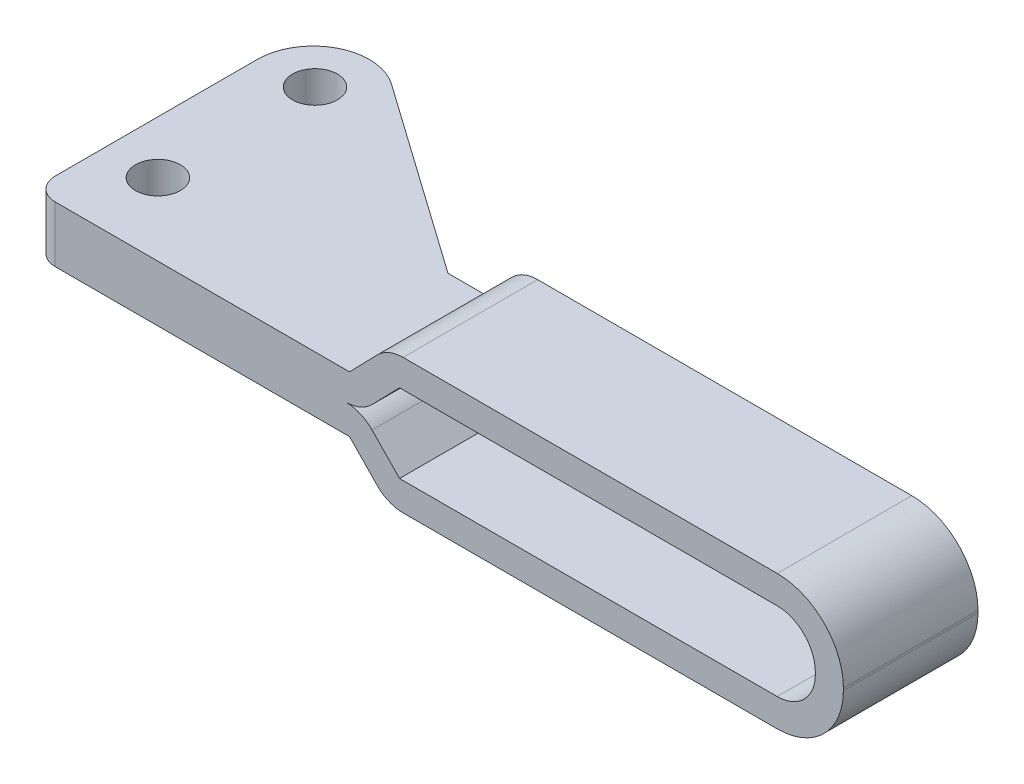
ISO-10303-21;
HEADER;
FILE_DESCRIPTION(('STEP AP214'),'2;1');
FILE_NAME('part.step','',(''),(''),'','','');
FILE_SCHEMA(('AUTOMOTIVE_DESIGN { 1 0 10303 214 1 1 1 1 }'));
ENDSEC;
DATA;
#1=APPLICATION_CONTEXT('core data for automotive mechanical design processes');
#2=APPLICATION_PROTOCOL_DEFINITION('international standard','automotive_design',2000,#1);
#3=PRODUCT_CONTEXT('',#1,'mechanical');
#4=PRODUCT('Part','Part','',(#3));
#5=PRODUCT_RELATED_PRODUCT_CATEGORY('part','',(#4));
#6=PRODUCT_DEFINITION_FORMATION('','',#4);
#7=PRODUCT_DEFINITION_CONTEXT('part definition',#1,'design');
#8=PRODUCT_DEFINITION('design','',#6,#7);
#9=PRODUCT_DEFINITION_SHAPE('','',#8);
#10=(LENGTH_UNIT() NAMED_UNIT(*) SI_UNIT(.MILLI.,.METRE.));
#11=(NAMED_UNIT(*) PLANE_ANGLE_UNIT() SI_UNIT($,.RADIAN.));
#12=(NAMED_UNIT(*) SI_UNIT($,.STERADIAN.) SOLID_ANGLE_UNIT());
#13=UNCERTAINTY_MEASURE_WITH_UNIT(LENGTH_MEASURE(1.E-05),#10,'distance_accuracy_value','');
#14=(GEOMETRIC_REPRESENTATION_CONTEXT(3) GLOBAL_UNCERTAINTY_ASSIGNED_CONTEXT((#13)) GLOBAL_UNIT_ASSIGNED_CONTEXT((#10,
#11,#12)) REPRESENTATION_CONTEXT('',''));
#15=CARTESIAN_POINT('',(0.,0.,0.));
#16=DIRECTION('',(0.,0.,1.));
#17=DIRECTION('',(1.,0.,0.));
#18=AXIS2_PLACEMENT_3D('',#15,#16,#17);
#19=CARTESIAN_POINT('',(0.,2.5,-14.));
#20=DIRECTION('',(0.,1.,0.));
#21=DIRECTION('',(-1.,0.,0.));
#22=AXIS2_PLACEMENT_3D('',#19,#20,#21);
#23=CYLINDRICAL_SURFACE('',#22,2.);
#24=CARTESIAN_POINT('',(0.,-2.49999999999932,-14.0000000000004));
#25=DIRECTION('',(0.,-1.,0.));
#26=DIRECTION('',(1.,0.,0.));
#27=AXIS2_PLACEMENT_3D('',#24,#25,#26);
#28=CIRCLE('',#27,2.);
#29=CARTESIAN_POINT('',(1.99999999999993,-2.49999999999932,-14.0000000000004));
#30=VERTEX_POINT('',#29);
#31=EDGE_CURVE('E495',#30,#30,#28,.T.);
#32=ORIENTED_EDGE('',*,*,#31,.T.);
#33=EDGE_LOOP('',(#32));
#34=FACE_BOUND('',#33,.T.);
#35=CARTESIAN_POINT('',(0.,2.5,-14.));
#36=DIRECTION('',(0.,1.,0.));
#37=DIRECTION('',(-1.,0.,0.));
#38=AXIS2_PLACEMENT_3D('',#35,#36,#37);
#39=CIRCLE('',#38,2.);
#40=CARTESIAN_POINT('',(-2.00000000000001,2.5,-14.));
#41=VERTEX_POINT('',#40);
#42=EDGE_CURVE('E11',#41,#41,#39,.T.);
#43=ORIENTED_EDGE('',*,*,#42,.T.);
#44=EDGE_LOOP('',(#43));
#45=FACE_BOUND('',#44,.T.);
#46=ADVANCED_FACE('F17',(#34,#45),#23,.F.);
#47=CARTESIAN_POINT('',(0.,2.5,0.));
#48=DIRECTION('',(0.,1.,0.));
#49=DIRECTION('',(-1.,0.,0.));
#50=AXIS2_PLACEMENT_3D('',#47,#48,#49);
#51=CYLINDRICAL_SURFACE('',#50,2.);
#52=CARTESIAN_POINT('',(0.,-2.49999999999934,-4.23272528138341E-13));
#53=DIRECTION('',(0.,-1.,0.));
#54=DIRECTION('',(1.,0.,0.));
#55=AXIS2_PLACEMENT_3D('',#52,#53,#54);
#56=CIRCLE('',#55,2.);
#57=CARTESIAN_POINT('',(1.99999999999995,-2.49999999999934,-4.26991775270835E-13));
#58=VERTEX_POINT('',#57);
#59=EDGE_CURVE('E388',#58,#58,#56,.T.);
#60=ORIENTED_EDGE('',*,*,#59,.T.);
#61=EDGE_LOOP('',(#60));
#62=FACE_BOUND('',#61,.T.);
#63=CARTESIAN_POINT('',(0.,2.5,0.));
#64=DIRECTION('',(0.,1.,0.));
#65=DIRECTION('',(-1.,0.,0.));
#66=AXIS2_PLACEMENT_3D('',#63,#64,#65);
#67=CIRCLE('',#66,2.);
#68=CARTESIAN_POINT('',(-1.99999999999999,2.5,0.));
#69=VERTEX_POINT('',#68);
#70=EDGE_CURVE('E28',#69,#69,#67,.T.);
#71=ORIENTED_EDGE('',*,*,#70,.T.);
#72=EDGE_LOOP('',(#71));
#73=FACE_BOUND('',#72,.T.);
#74=ADVANCED_FACE('F554',(#62,#73),#51,.F.);
#75=CARTESIAN_POINT('',(-3.99847823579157,6.00163537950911,4.45));
#76=DIRECTION('',(0.,1.,0.));
#77=DIRECTION('',(0.,0.,-1.));
#78=AXIS2_PLACEMENT_3D('',#75,#76,#77);
#79=PLANE('',#78);
#80=DIRECTION('',(1.,0.,0.));
#81=VECTOR('',#80,1.);
#82=CARTESIAN_POINT('',(69.0080963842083,6.00163537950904,6.44999999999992));
#83=LINE('',#82,#81);
#84=CARTESIAN_POINT('',(28.3021014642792,6.00163537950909,6.45));
#85=VERTEX_POINT('',#84);
#86=CARTESIAN_POINT('',(61.650000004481,6.00163537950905,6.45));
#87=VERTEX_POINT('',#86);
#88=EDGE_CURVE('E359',#85,#87,#83,.T.);
#89=ORIENTED_EDGE('',*,*,#88,.T.);
#90=DIRECTION('',(0.,0.,-1.));
#91=VECTOR('',#90,1.);
#92=CARTESIAN_POINT('',(61.650000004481,6.00163537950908,4.44999999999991));
#93=LINE('',#92,#91);
#94=CARTESIAN_POINT('',(61.6500000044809,6.00163537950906,-5.55000000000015));
#95=VERTEX_POINT('',#94);
#96=EDGE_CURVE('E42',#87,#95,#93,.T.);
#97=ORIENTED_EDGE('',*,*,#96,.T.);
#98=DIRECTION('',(-1.,0.,0.));
#99=VECTOR('',#98,1.);
#100=CARTESIAN_POINT('',(19.0080963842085,6.00163537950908,-5.55));
#101=LINE('',#100,#99);
#102=CARTESIAN_POINT('',(28.3021014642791,6.0016353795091,-5.55));
#103=VERTEX_POINT('',#102);
#104=EDGE_CURVE('E317',#95,#103,#101,.T.);
#105=ORIENTED_EDGE('',*,*,#104,.T.);
#106=DIRECTION('',(0.,0.,-1.));
#107=VECTOR('',#106,1.);
#108=CARTESIAN_POINT('',(28.3021014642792,6.00163537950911,4.44999999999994));
#109=LINE('',#108,#107);
#110=EDGE_CURVE('E266',#85,#103,#109,.T.);
#111=ORIENTED_EDGE('',*,*,#110,.F.);
#112=EDGE_LOOP('',(#89,#97,#105,#111));
#113=FACE_BOUND('',#112,.T.);
#114=ADVANCED_FACE('F549',(#113),#79,.T.);
#115=CARTESIAN_POINT('',(4.5700168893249,-16.9966869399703,4.44999999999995));
#116=DIRECTION('',(-0.716910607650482,0.697165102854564,0.));
#117=DIRECTION('',(0.,0.,-1.));
#118=AXIS2_PLACEMENT_3D('',#115,#116,#117);
#119=PLANE('',#118);
#120=DIRECTION('',(-0.697165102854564,-0.716910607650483,0.));
#121=VECTOR('',#120,1.);
#122=CARTESIAN_POINT('',(20.6093978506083,-0.503029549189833,-5.55));
#123=LINE('',#122,#121);
#124=CARTESIAN_POINT('',(25.9817485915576,5.02147995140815,-5.55));
#125=VERTEX_POINT('',#124);
#126=CARTESIAN_POINT('',(23.5297164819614,2.5,-5.55));
#127=VERTEX_POINT('',#126);
#128=EDGE_CURVE('E314',#125,#127,#123,.T.);
#129=ORIENTED_EDGE('',*,*,#128,.T.);
#130=DIRECTION('',(0.,0.,1.));
#131=VECTOR('',#130,1.);
#132=CARTESIAN_POINT('',(23.5297164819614,2.5,4.45));
#133=LINE('',#132,#131);
#134=CARTESIAN_POINT('',(23.5297164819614,2.5,6.45));
#135=VERTEX_POINT('',#134);
#136=EDGE_CURVE('E21',#127,#135,#133,.T.);
#137=ORIENTED_EDGE('',*,*,#136,.T.);
#138=DIRECTION('',(0.697165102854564,0.716910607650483,0.));
#139=VECTOR('',#138,1.);
#140=CARTESIAN_POINT('',(55.4676529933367,35.3425008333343,6.45));
#141=LINE('',#140,#139);
#142=CARTESIAN_POINT('',(25.9817485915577,5.02147995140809,6.45));
#143=VERTEX_POINT('',#142);
#144=EDGE_CURVE('E305',#135,#143,#141,.T.);
#145=ORIENTED_EDGE('',*,*,#144,.T.);
#146=DIRECTION('',(0.,0.,-1.));
#147=VECTOR('',#146,1.);
#148=CARTESIAN_POINT('',(25.9817485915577,5.02147995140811,4.44999999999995));
#149=LINE('',#148,#147);
#150=EDGE_CURVE('E308',#143,#125,#149,.T.);
#151=ORIENTED_EDGE('',*,*,#150,.T.);
#152=EDGE_LOOP('',(#129,#137,#145,#151));
#153=FACE_BOUND('',#152,.T.);
#154=ADVANCED_FACE('F543',(#153),#119,.T.);
#155=CARTESIAN_POINT('',(20.6093978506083,-0.503029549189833,-5.55));
#156=DIRECTION('',(0.,0.,1.));
#157=DIRECTION('',(-0.697165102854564,0.716910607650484,0.));
#158=AXIS2_PLACEMENT_3D('',#155,#156,#157);
#159=PLANE('',#158);
#160=CARTESIAN_POINT('',(61.6500000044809,-0.101635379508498,-5.55000000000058));
#161=DIRECTION('',(0.,0.,-1.));
#162=DIRECTION('',(0.,-1.,0.));
#163=AXIS2_PLACEMENT_3D('',#160,#161,#162);
#164=CIRCLE('',#163,3.4);
#165=CARTESIAN_POINT('',(65.0500000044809,-0.101635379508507,-5.55000000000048));
#166=VERTEX_POINT('',#165);
#167=CARTESIAN_POINT('',(61.6500000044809,-3.50163537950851,-5.55000000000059));
#168=VERTEX_POINT('',#167);
#169=EDGE_CURVE('E400',#166,#168,#164,.T.);
#170=ORIENTED_EDGE('',*,*,#169,.F.);
#171=DIRECTION('',(0.,1.,0.));
#172=VECTOR('',#171,1.);
#173=CARTESIAN_POINT('',(65.0500000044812,50.0477419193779,-5.55000000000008));
#174=LINE('',#173,#172);
#175=CARTESIAN_POINT('',(65.050000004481,0.101635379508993,-5.55000000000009));
#176=VERTEX_POINT('',#175);
#177=EDGE_CURVE('E271',#166,#176,#174,.T.);
#178=ORIENTED_EDGE('',*,*,#177,.T.);
#179=CARTESIAN_POINT('',(61.6500000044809,0.101635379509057,-5.55000000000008));
#180=DIRECTION('',(0.,0.,1.));
#181=DIRECTION('',(-0.697165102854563,0.716910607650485,0.));
#182=AXIS2_PLACEMENT_3D('',#179,#180,#181);
#183=CIRCLE('',#182,3.4);
#184=CARTESIAN_POINT('',(61.6500000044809,3.50163537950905,-5.55));
#185=VERTEX_POINT('',#184);
#186=EDGE_CURVE('E245',#176,#185,#183,.T.);
#187=ORIENTED_EDGE('',*,*,#186,.T.);
#188=DIRECTION('',(-1.,0.,0.));
#189=VECTOR('',#188,1.);
#190=CARTESIAN_POINT('',(19.0080963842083,3.50163537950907,-5.55000000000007));
#191=LINE('',#190,#189);
#192=CARTESIAN_POINT('',(27.9909494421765,3.50163537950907,-5.55));
#193=VERTEX_POINT('',#192);
#194=EDGE_CURVE('E257',#185,#193,#191,.T.);
#195=ORIENTED_EDGE('',*,*,#194,.T.);
#196=DIRECTION('',(-0.697165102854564,-0.716910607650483,0.));
#197=VECTOR('',#196,1.);
#198=CARTESIAN_POINT('',(22.4016743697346,-2.24594230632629,-5.55));
#199=LINE('',#198,#197);
#200=CARTESIAN_POINT('',(25.5389173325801,0.980155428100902,-5.55));
#201=VERTEX_POINT('',#200);
#202=EDGE_CURVE('E351',#193,#201,#199,.T.);
#203=ORIENTED_EDGE('',*,*,#202,.T.);
#204=CARTESIAN_POINT('',(23.2185644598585,3.2366,-5.55));
#205=DIRECTION('',(0.,0.,-1.));
#206=DIRECTION('',(-0.697165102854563,0.716910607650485,0.));
#207=AXIS2_PLACEMENT_3D('',#204,#205,#206);
#208=CIRCLE('',#207,3.2366);
#209=CARTESIAN_POINT('',(23.2185644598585,0.,-5.55));
#210=VERTEX_POINT('',#209);
#211=EDGE_CURVE('E301',#201,#210,#208,.T.);
#212=ORIENTED_EDGE('',*,*,#211,.T.);
#213=CARTESIAN_POINT('',(23.2185644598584,-3.23659999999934,-5.55000000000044));
#214=DIRECTION('',(0.,0.,1.));
#215=DIRECTION('',(0.,1.,0.));
#216=AXIS2_PLACEMENT_3D('',#213,#214,#215);
#217=CIRCLE('',#216,3.2366);
#218=CARTESIAN_POINT('',(25.5389173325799,-0.980155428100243,-5.55000000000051));
#219=VERTEX_POINT('',#218);
#220=EDGE_CURVE('E455',#219,#210,#217,.T.);
#221=ORIENTED_EDGE('',*,*,#220,.F.);
#222=DIRECTION('',(-0.697165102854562,0.716910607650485,0.));
#223=VECTOR('',#222,1.);
#224=CARTESIAN_POINT('',(22.4016743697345,2.24594230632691,-5.5500000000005));
#225=LINE('',#224,#223);
#226=CARTESIAN_POINT('',(27.9909494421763,-3.50163537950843,-5.55));
#227=VERTEX_POINT('',#226);
#228=EDGE_CURVE('E395',#227,#219,#225,.T.);
#229=ORIENTED_EDGE('',*,*,#228,.F.);
#230=DIRECTION('',(-1.,0.,0.));
#231=VECTOR('',#230,1.);
#232=CARTESIAN_POINT('',(19.0080963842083,-3.50163537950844,-5.5500000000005));
#233=LINE('',#232,#231);
#234=EDGE_CURVE('E424',#168,#227,#233,.T.);
#235=ORIENTED_EDGE('',*,*,#234,.F.);
#236=EDGE_LOOP('',(#170,#178,#187,#195,#203,#212,#221,#229,#235));
#237=FACE_BOUND('',#236,.T.);
#238=DIRECTION('',(0.,1.,0.));
#239=VECTOR('',#238,1.);
#240=CARTESIAN_POINT('',(67.5500000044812,50.0477419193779,-5.55));
#241=LINE('',#240,#239);
#242=CARTESIAN_POINT('',(67.5500000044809,-0.101635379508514,-5.55000000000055));
#243=VERTEX_POINT('',#242);
#244=CARTESIAN_POINT('',(67.5500000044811,0.101635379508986,-5.55000000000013));
#245=VERTEX_POINT('',#244);
#246=EDGE_CURVE('E288',#243,#245,#241,.T.);
#247=ORIENTED_EDGE('',*,*,#246,.F.);
#248=CARTESIAN_POINT('',(61.6500000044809,-0.101635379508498,-5.55000000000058));
#249=DIRECTION('',(0.,0.,-1.));
#250=DIRECTION('',(0.,-1.,0.));
#251=AXIS2_PLACEMENT_3D('',#248,#249,#250);
#252=CIRCLE('',#251,5.9);
#253=CARTESIAN_POINT('',(61.6500000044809,-6.0016353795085,-5.55000000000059));
#254=VERTEX_POINT('',#253);
#255=EDGE_CURVE('E432',#243,#254,#252,.T.);
#256=ORIENTED_EDGE('',*,*,#255,.T.);
#257=DIRECTION('',(-1.,0.,0.));
#258=VECTOR('',#257,1.);
#259=CARTESIAN_POINT('',(19.0080963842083,-6.00163537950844,-5.55000000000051));
#260=LINE('',#259,#258);
#261=CARTESIAN_POINT('',(28.3021014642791,-6.00163537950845,-5.5500000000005));
#262=VERTEX_POINT('',#261);
#263=EDGE_CURVE('E446',#254,#262,#260,.T.);
#264=ORIENTED_EDGE('',*,*,#263,.T.);
#265=CARTESIAN_POINT('',(28.3021014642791,-2.76503537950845,-5.55000000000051));
#266=DIRECTION('',(0.,0.,-1.));
#267=DIRECTION('',(-0.697165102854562,0.716910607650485,0.));
#268=AXIS2_PLACEMENT_3D('',#265,#266,#267);
#269=CIRCLE('',#268,3.2366);
#270=CARTESIAN_POINT('',(25.9817485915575,-5.02147995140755,-5.55000000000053));
#271=VERTEX_POINT('',#270);
#272=EDGE_CURVE('E399',#262,#271,#269,.T.);
#273=ORIENTED_EDGE('',*,*,#272,.T.);
#274=DIRECTION('',(-0.697165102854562,0.716910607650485,0.));
#275=VECTOR('',#274,1.);
#276=CARTESIAN_POINT('',(20.6093978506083,0.503029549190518,-5.55000000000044));
#277=LINE('',#276,#275);
#278=CARTESIAN_POINT('',(23.5297164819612,-2.49999999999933,-5.55));
#279=VERTEX_POINT('',#278);
#280=EDGE_CURVE('E428',#271,#279,#277,.T.);
#281=ORIENTED_EDGE('',*,*,#280,.T.);
#282=DIRECTION('',(-1.,0.,0.));
#283=VECTOR('',#282,1.);
#284=CARTESIAN_POINT('',(20.3065746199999,-2.49999999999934,-5.55000000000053));
#285=LINE('',#284,#283);
#286=CARTESIAN_POINT('',(20.3065746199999,-2.49999999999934,-5.55000000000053));
#287=VERTEX_POINT('',#286);
#288=EDGE_CURVE('E440',#279,#287,#285,.T.);
#289=ORIENTED_EDGE('',*,*,#288,.T.);
#290=DIRECTION('',(0.,-1.,0.));
#291=VECTOR('',#290,1.);
#292=CARTESIAN_POINT('',(20.30657462,2.49999999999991,-5.55));
#293=LINE('',#292,#291);
#294=CARTESIAN_POINT('',(20.30657462,2.49999999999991,-5.55));
#295=VERTEX_POINT('',#294);
#296=EDGE_CURVE('E313',#295,#287,#293,.T.);
#297=ORIENTED_EDGE('',*,*,#296,.F.);
#298=DIRECTION('',(-1.,0.,0.));
#299=VECTOR('',#298,1.);
#300=CARTESIAN_POINT('',(20.30657462,2.49999999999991,-5.55));
#301=LINE('',#300,#299);
#302=EDGE_CURVE('E320',#127,#295,#301,.T.);
#303=ORIENTED_EDGE('',*,*,#302,.F.);
#304=ORIENTED_EDGE('',*,*,#128,.F.);
#305=CARTESIAN_POINT('',(28.3021014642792,2.76503537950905,-5.55000000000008));
#306=DIRECTION('',(0.,0.,1.));
#307=DIRECTION('',(1.,0.,0.));
#308=AXIS2_PLACEMENT_3D('',#305,#306,#307);
#309=CIRCLE('',#308,3.2366);
#310=EDGE_CURVE('E329',#103,#125,#309,.T.);
#311=ORIENTED_EDGE('',*,*,#310,.F.);
#312=ORIENTED_EDGE('',*,*,#104,.F.);
#313=CARTESIAN_POINT('',(61.6500000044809,0.101635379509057,-5.55000000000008));
#314=DIRECTION('',(0.,0.,1.));
#315=DIRECTION('',(0.697165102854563,-0.716910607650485,0.));
#316=AXIS2_PLACEMENT_3D('',#313,#314,#315);
#317=CIRCLE('',#316,5.9);
#318=EDGE_CURVE('E283',#245,#95,#317,.T.);
#319=ORIENTED_EDGE('',*,*,#318,.F.);
#320=EDGE_LOOP('',(#247,#256,#264,#273,#281,#289,#297,#303,#304,#311,#312,#319));
#321=FACE_BOUND('',#320,.T.);
#322=ADVANCED_FACE('F269',(#237,#321),#159,.F.);
#323=CARTESIAN_POINT('',(55.4676529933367,35.3425008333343,6.45));
#324=DIRECTION('',(0.,0.,-1.));
#325=DIRECTION('',(0.697165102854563,-0.716910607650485,0.));
#326=AXIS2_PLACEMENT_3D('',#323,#324,#325);
#327=PLANE('',#326);
#328=DIRECTION('',(0.,-1.,0.));
#329=VECTOR('',#328,1.);
#330=CARTESIAN_POINT('',(65.0500000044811,0.0477419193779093,6.44999999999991));
#331=LINE('',#330,#329);
#332=CARTESIAN_POINT('',(65.0500000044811,0.101635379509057,6.44999999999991));
#333=VERTEX_POINT('',#332);
#334=CARTESIAN_POINT('',(65.050000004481,-0.101635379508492,6.44999999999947));
#335=VERTEX_POINT('',#334);
#336=EDGE_CURVE('E291',#333,#335,#331,.T.);
#337=ORIENTED_EDGE('',*,*,#336,.T.);
#338=CARTESIAN_POINT('',(61.650000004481,-0.101635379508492,6.44999999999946));
#339=DIRECTION('',(0.,0.,1.));
#340=DIRECTION('',(0.,1.,0.));
#341=AXIS2_PLACEMENT_3D('',#338,#339,#340);
#342=CIRCLE('',#341,3.4);
#343=CARTESIAN_POINT('',(61.6500000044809,-3.5016353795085,6.44999999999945));
#344=VERTEX_POINT('',#343);
#345=EDGE_CURVE('E404',#344,#335,#342,.T.);
#346=ORIENTED_EDGE('',*,*,#345,.F.);
#347=DIRECTION('',(1.,0.,0.));
#348=VECTOR('',#347,1.);
#349=CARTESIAN_POINT('',(69.0080963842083,-3.50163537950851,6.44999999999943));
#350=LINE('',#349,#348);
#351=CARTESIAN_POINT('',(27.9909494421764,-3.50163537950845,6.45));
#352=VERTEX_POINT('',#351);
#353=EDGE_CURVE('E389',#352,#344,#350,.T.);
#354=ORIENTED_EDGE('',*,*,#353,.F.);
#355=DIRECTION('',(0.697165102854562,-0.716910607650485,0.));
#356=VECTOR('',#355,1.);
#357=CARTESIAN_POINT('',(57.2599295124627,-33.5995880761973,6.44999999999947));
#358=LINE('',#357,#356);
#359=CARTESIAN_POINT('',(25.53891733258,-0.98015542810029,6.44999999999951));
#360=VERTEX_POINT('',#359);
#361=EDGE_CURVE('E394',#360,#352,#358,.T.);
#362=ORIENTED_EDGE('',*,*,#361,.F.);
#363=CARTESIAN_POINT('',(23.2185644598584,-3.23659999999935,6.44999999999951));
#364=DIRECTION('',(0.,0.,-1.));
#365=DIRECTION('',(0.,-1.,0.));
#366=AXIS2_PLACEMENT_3D('',#363,#364,#365);
#367=CIRCLE('',#366,3.2366);
#368=CARTESIAN_POINT('',(23.2185644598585,0.,6.45));
#369=VERTEX_POINT('',#368);
#370=EDGE_CURVE('E485',#369,#360,#367,.T.);
#371=ORIENTED_EDGE('',*,*,#370,.F.);
#372=CARTESIAN_POINT('',(23.2185644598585,3.23659999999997,6.45));
#373=DIRECTION('',(0.,0.,1.));
#374=DIRECTION('',(-0.697165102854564,0.716910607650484,0.));
#375=AXIS2_PLACEMENT_3D('',#372,#373,#374);
#376=CIRCLE('',#375,3.2366);
#377=CARTESIAN_POINT('',(25.5389173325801,0.980155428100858,6.45));
#378=VERTEX_POINT('',#377);
#379=EDGE_CURVE('E297',#369,#378,#376,.T.);
#380=ORIENTED_EDGE('',*,*,#379,.T.);
#381=DIRECTION('',(0.697165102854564,0.716910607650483,0.));
#382=VECTOR('',#381,1.);
#383=CARTESIAN_POINT('',(57.2599295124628,33.5995880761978,6.44999999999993));
#384=LINE('',#383,#382);
#385=CARTESIAN_POINT('',(27.9909494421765,3.50163537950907,6.45));
#386=VERTEX_POINT('',#385);
#387=EDGE_CURVE('E348',#378,#386,#384,.T.);
#388=ORIENTED_EDGE('',*,*,#387,.T.);
#389=DIRECTION('',(1.,0.,0.));
#390=VECTOR('',#389,1.);
#391=CARTESIAN_POINT('',(69.0080963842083,3.50163537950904,6.4499999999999));
#392=LINE('',#391,#390);
#393=CARTESIAN_POINT('',(61.650000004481,3.50163537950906,6.44999999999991));
#394=VERTEX_POINT('',#393);
#395=EDGE_CURVE('E265',#386,#394,#392,.T.);
#396=ORIENTED_EDGE('',*,*,#395,.T.);
#397=CARTESIAN_POINT('',(61.650000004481,0.101635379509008,6.4499999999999));
#398=DIRECTION('',(0.,0.,-1.));
#399=DIRECTION('',(-0.697165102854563,0.716910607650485,0.));
#400=AXIS2_PLACEMENT_3D('',#397,#398,#399);
#401=CIRCLE('',#400,3.4);
#402=EDGE_CURVE('E248',#394,#333,#401,.T.);
#403=ORIENTED_EDGE('',*,*,#402,.T.);
#404=EDGE_LOOP('',(#337,#346,#354,#362,#371,#380,#388,#396,#403));
#405=FACE_BOUND('',#404,.T.);
#406=ORIENTED_EDGE('',*,*,#144,.F.);
#407=DIRECTION('',(1.,0.,0.));
#408=VECTOR('',#407,1.);
#409=CARTESIAN_POINT('',(70.30657462,2.49999999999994,6.44999999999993));
#410=LINE('',#409,#408);
#411=CARTESIAN_POINT('',(-2.69999999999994,2.5,6.45));
#412=VERTEX_POINT('',#411);
#413=EDGE_CURVE('E287',#412,#135,#410,.T.);
#414=ORIENTED_EDGE('',*,*,#413,.F.);
#415=DIRECTION('',(0.,-1.,0.));
#416=VECTOR('',#415,1.);
#417=CARTESIAN_POINT('',(-2.69999999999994,2.5,6.45));
#418=LINE('',#417,#416);
#419=CARTESIAN_POINT('',(-2.70000000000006,-2.49999999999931,6.44999999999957));
#420=VERTEX_POINT('',#419);
#421=EDGE_CURVE('E295',#412,#420,#418,.T.);
#422=ORIENTED_EDGE('',*,*,#421,.T.);
#423=DIRECTION('',(1.,0.,0.));
#424=VECTOR('',#423,1.);
#425=CARTESIAN_POINT('',(70.3065746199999,-2.4999999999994,6.44999999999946));
#426=LINE('',#425,#424);
#427=CARTESIAN_POINT('',(23.5297164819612,-2.49999999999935,6.45));
#428=VERTEX_POINT('',#427);
#429=EDGE_CURVE('E437',#420,#428,#426,.T.);
#430=ORIENTED_EDGE('',*,*,#429,.T.);
#431=DIRECTION('',(0.697165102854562,-0.716910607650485,0.));
#432=VECTOR('',#431,1.);
#433=CARTESIAN_POINT('',(55.4676529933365,-35.3425008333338,6.4499999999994));
#434=LINE('',#433,#432);
#435=CARTESIAN_POINT('',(25.9817485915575,-5.02147995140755,6.44999999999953));
#436=VERTEX_POINT('',#435);
#437=EDGE_CURVE('E442',#428,#436,#434,.T.);
#438=ORIENTED_EDGE('',*,*,#437,.T.);
#439=CARTESIAN_POINT('',(28.3021014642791,-2.7650353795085,6.44999999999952));
#440=DIRECTION('',(0.,0.,1.));
#441=DIRECTION('',(-0.697165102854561,0.716910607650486,0.));
#442=AXIS2_PLACEMENT_3D('',#439,#440,#441);
#443=CIRCLE('',#442,3.2366);
#444=CARTESIAN_POINT('',(28.3021014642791,-6.0016353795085,6.44999999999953));
#445=VERTEX_POINT('',#444);
#446=EDGE_CURVE('E409',#436,#445,#443,.T.);
#447=ORIENTED_EDGE('',*,*,#446,.T.);
#448=DIRECTION('',(1.,0.,0.));
#449=VECTOR('',#448,1.);
#450=CARTESIAN_POINT('',(69.0080963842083,-6.00163537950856,6.44999999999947));
#451=LINE('',#450,#449);
#452=CARTESIAN_POINT('',(61.6500000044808,-6.00163537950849,6.44999999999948));
#453=VERTEX_POINT('',#452);
#454=EDGE_CURVE('E462',#445,#453,#451,.T.);
#455=ORIENTED_EDGE('',*,*,#454,.T.);
#456=CARTESIAN_POINT('',(61.650000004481,-0.101635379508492,6.44999999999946));
#457=DIRECTION('',(0.,0.,1.));
#458=DIRECTION('',(0.,-1.,0.));
#459=AXIS2_PLACEMENT_3D('',#456,#457,#458);
#460=CIRCLE('',#459,5.9);
#461=CARTESIAN_POINT('',(67.550000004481,-0.101635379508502,6.44999999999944));
#462=VERTEX_POINT('',#461);
#463=EDGE_CURVE('E431',#453,#462,#460,.T.);
#464=ORIENTED_EDGE('',*,*,#463,.T.);
#465=DIRECTION('',(0.,-1.,0.));
#466=VECTOR('',#465,1.);
#467=CARTESIAN_POINT('',(67.550000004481,0.0477419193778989,6.45));
#468=LINE('',#467,#466);
#469=CARTESIAN_POINT('',(67.550000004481,0.101635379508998,6.45));
#470=VERTEX_POINT('',#469);
#471=EDGE_CURVE('E254',#470,#462,#468,.T.);
#472=ORIENTED_EDGE('',*,*,#471,.F.);
#473=CARTESIAN_POINT('',(61.650000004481,0.101635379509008,6.4499999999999));
#474=DIRECTION('',(0.,0.,-1.));
#475=DIRECTION('',(-0.697165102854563,0.716910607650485,0.));
#476=AXIS2_PLACEMENT_3D('',#473,#474,#475);
#477=CIRCLE('',#476,5.9);
#478=EDGE_CURVE('E253',#87,#470,#477,.T.);
#479=ORIENTED_EDGE('',*,*,#478,.F.);
#480=ORIENTED_EDGE('',*,*,#88,.F.);
#481=CARTESIAN_POINT('',(28.3021014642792,2.76503537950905,6.45));
#482=DIRECTION('',(0.,0.,-1.));
#483=DIRECTION('',(0.,-1.,0.));
#484=AXIS2_PLACEMENT_3D('',#481,#482,#483);
#485=CIRCLE('',#484,3.2366);
#486=EDGE_CURVE('E335',#143,#85,#485,.T.);
#487=ORIENTED_EDGE('',*,*,#486,.F.);
#488=EDGE_LOOP('',(#406,#414,#422,#430,#438,#447,#455,#464,#472,#479,#480,#487));
#489=FACE_BOUND('',#488,.T.);
#490=ADVANCED_FACE('F542',(#405,#489),#327,.F.);
#491=CARTESIAN_POINT('',(6.36229340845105,-18.7395996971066,4.45));
#492=DIRECTION('',(-0.716910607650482,0.697165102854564,0.));
#493=DIRECTION('',(0.,0.,-1.));
#494=AXIS2_PLACEMENT_3D('',#491,#492,#493);
#495=PLANE('',#494);
#496=DIRECTION('',(0.,0.,1.));
#497=VECTOR('',#496,1.);
#498=CARTESIAN_POINT('',(25.5389173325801,0.980155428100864,4.44999999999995));
#499=LINE('',#498,#497);
#500=EDGE_CURVE('E279',#201,#378,#499,.T.);
#501=ORIENTED_EDGE('',*,*,#500,.F.);
#502=ORIENTED_EDGE('',*,*,#202,.F.);
#503=DIRECTION('',(0.,0.,-1.));
#504=VECTOR('',#503,1.);
#505=CARTESIAN_POINT('',(27.9909494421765,3.50163537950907,4.45));
#506=LINE('',#505,#504);
#507=EDGE_CURVE('E260',#386,#193,#506,.T.);
#508=ORIENTED_EDGE('',*,*,#507,.F.);
#509=ORIENTED_EDGE('',*,*,#387,.F.);
#510=EDGE_LOOP('',(#501,#502,#508,#509));
#511=FACE_BOUND('',#510,.T.);
#512=ADVANCED_FACE('F563',(#511),#495,.F.);
#513=CARTESIAN_POINT('',(-3.99847823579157,3.5016353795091,4.45));
#514=DIRECTION('',(0.,1.,0.));
#515=DIRECTION('',(0.,0.,-1.));
#516=AXIS2_PLACEMENT_3D('',#513,#514,#515);
#517=PLANE('',#516);
#518=DIRECTION('',(0.,0.,-1.));
#519=VECTOR('',#518,1.);
#520=CARTESIAN_POINT('',(61.650000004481,3.50163537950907,4.44999999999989));
#521=LINE('',#520,#519);
#522=EDGE_CURVE('E241',#394,#185,#521,.T.);
#523=ORIENTED_EDGE('',*,*,#522,.F.);
#524=ORIENTED_EDGE('',*,*,#395,.F.);
#525=ORIENTED_EDGE('',*,*,#507,.T.);
#526=ORIENTED_EDGE('',*,*,#194,.F.);
#527=EDGE_LOOP('',(#523,#524,#525,#526));
#528=FACE_BOUND('',#527,.T.);
#529=ADVANCED_FACE('F258',(#528),#517,.F.);
#530=CARTESIAN_POINT('',(28.3021014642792,2.76503537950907,-11.9100880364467));
#531=DIRECTION('',(0.,0.,1.));
#532=DIRECTION('',(1.,0.,0.));
#533=AXIS2_PLACEMENT_3D('',#530,#531,#532);
#534=CYLINDRICAL_SURFACE('',#533,3.2366);
#535=ORIENTED_EDGE('',*,*,#110,.T.);
#536=ORIENTED_EDGE('',*,*,#310,.T.);
#537=ORIENTED_EDGE('',*,*,#150,.F.);
#538=ORIENTED_EDGE('',*,*,#486,.T.);
#539=EDGE_LOOP('',(#535,#536,#537,#538));
#540=FACE_BOUND('',#539,.T.);
#541=ADVANCED_FACE('F589',(#540),#534,.T.);
#542=CARTESIAN_POINT('',(-2.7,2.5,4.45));
#543=DIRECTION('',(0.,-1.,0.));
#544=DIRECTION('',(1.,0.,0.));
#545=AXIS2_PLACEMENT_3D('',#542,#543,#544);
#546=CYLINDRICAL_SURFACE('',#545,2.);
#547=DIRECTION('',(0.,-1.,0.));
#548=VECTOR('',#547,1.);
#549=CARTESIAN_POINT('',(-4.7,2.50000000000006,4.45));
#550=LINE('',#549,#548);
#551=CARTESIAN_POINT('',(-4.7,2.50000000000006,4.45));
#552=VERTEX_POINT('',#551);
#553=CARTESIAN_POINT('',(-4.7,-2.4999999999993,4.4499999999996));
#554=VERTEX_POINT('',#553);
#555=EDGE_CURVE('E324',#552,#554,#550,.T.);
#556=ORIENTED_EDGE('',*,*,#555,.T.);
#557=CARTESIAN_POINT('',(-2.7,-2.49999999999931,4.44999999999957));
#558=DIRECTION('',(0.,1.,0.));
#559=DIRECTION('',(-1.,0.,0.));
#560=AXIS2_PLACEMENT_3D('',#557,#558,#559);
#561=CIRCLE('',#560,2.);
#562=EDGE_CURVE('E410',#554,#420,#561,.T.);
#563=ORIENTED_EDGE('',*,*,#562,.T.);
#564=ORIENTED_EDGE('',*,*,#421,.F.);
#565=CARTESIAN_POINT('',(-2.7,2.5,4.45));
#566=DIRECTION('',(0.,1.,0.));
#567=DIRECTION('',(-1.,0.,0.));
#568=AXIS2_PLACEMENT_3D('',#565,#566,#567);
#569=CIRCLE('',#568,2.);
#570=EDGE_CURVE('E352',#552,#412,#569,.T.);
#571=ORIENTED_EDGE('',*,*,#570,.F.);
#572=EDGE_LOOP('',(#556,#563,#564,#571));
#573=FACE_BOUND('',#572,.T.);
#574=ADVANCED_FACE('F594',(#573),#546,.T.);
#575=CARTESIAN_POINT('',(-4.7,2.50000000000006,4.45));
#576=DIRECTION('',(1.,0.,0.));
#577=DIRECTION('',(0.,0.,1.));
#578=AXIS2_PLACEMENT_3D('',#575,#576,#577);
#579=PLANE('',#578);
#580=DIRECTION('',(0.,-1.,0.));
#581=VECTOR('',#580,1.);
#582=CARTESIAN_POINT('',(-4.7,2.5,-13.55));
#583=LINE('',#582,#581);
#584=CARTESIAN_POINT('',(-4.7,2.5,-13.55));
#585=VERTEX_POINT('',#584);
#586=CARTESIAN_POINT('',(-4.70000000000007,-2.49999999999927,-13.5500000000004));
#587=VERTEX_POINT('',#586);
#588=EDGE_CURVE('E312',#585,#587,#583,.T.);
#589=ORIENTED_EDGE('',*,*,#588,.T.);
#590=DIRECTION('',(0.,0.,1.));
#591=VECTOR('',#590,1.);
#592=CARTESIAN_POINT('',(-4.7,-2.4999999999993,4.4499999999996));
#593=LINE('',#592,#591);
#594=EDGE_CURVE('E419',#587,#554,#593,.T.);
#595=ORIENTED_EDGE('',*,*,#594,.T.);
#596=ORIENTED_EDGE('',*,*,#555,.F.);
#597=DIRECTION('',(0.,0.,1.));
#598=VECTOR('',#597,1.);
#599=CARTESIAN_POINT('',(-4.7,2.50000000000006,4.45));
#600=LINE('',#599,#598);
#601=EDGE_CURVE('E356',#585,#552,#600,.T.);
#602=ORIENTED_EDGE('',*,*,#601,.F.);
#603=EDGE_LOOP('',(#589,#595,#596,#602));
#604=FACE_BOUND('',#603,.T.);
#605=ADVANCED_FACE('F531',(#604),#579,.F.);
#606=CARTESIAN_POINT('',(0.300000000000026,2.49999999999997,-13.55));
#607=DIRECTION('',(0.,-1.,0.));
#608=DIRECTION('',(1.,0.,0.));
#609=AXIS2_PLACEMENT_3D('',#606,#607,#608);
#610=CYLINDRICAL_SURFACE('',#609,5.);
#611=DIRECTION('',(0.,-1.,0.));
#612=VECTOR('',#611,1.);
#613=CARTESIAN_POINT('',(3.18308220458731,2.5,-17.6350749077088));
#614=LINE('',#613,#612);
#615=CARTESIAN_POINT('',(3.18308220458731,2.5,-17.6350749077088));
#616=VERTEX_POINT('',#615);
#617=CARTESIAN_POINT('',(3.18308220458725,-2.49999999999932,-17.6350749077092));
#618=VERTEX_POINT('',#617);
#619=EDGE_CURVE('E309',#616,#618,#614,.T.);
#620=ORIENTED_EDGE('',*,*,#619,.T.);
#621=CARTESIAN_POINT('',(0.299999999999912,-2.49999999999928,-13.5500000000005));
#622=DIRECTION('',(0.,1.,0.));
#623=DIRECTION('',(1.,0.,0.));
#624=AXIS2_PLACEMENT_3D('',#621,#622,#623);
#625=CIRCLE('',#624,5.);
#626=EDGE_CURVE('E415',#618,#587,#625,.T.);
#627=ORIENTED_EDGE('',*,*,#626,.T.);
#628=ORIENTED_EDGE('',*,*,#588,.F.);
#629=CARTESIAN_POINT('',(0.300000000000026,2.49999999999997,-13.55));
#630=DIRECTION('',(0.,1.,0.));
#631=DIRECTION('',(1.,0.,0.));
#632=AXIS2_PLACEMENT_3D('',#629,#630,#631);
#633=CIRCLE('',#632,5.);
#634=EDGE_CURVE('E222',#616,#585,#633,.T.);
#635=ORIENTED_EDGE('',*,*,#634,.F.);
#636=EDGE_LOOP('',(#620,#627,#628,#635));
#637=FACE_BOUND('',#636,.T.);
#638=ADVANCED_FACE('F525',(#637),#610,.T.);
#639=CARTESIAN_POINT('',(3.18308220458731,2.5,-17.6350749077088));
#640=DIRECTION('',(-0.576616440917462,0.,0.817014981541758));
#641=DIRECTION('',(0.,-1.,0.));
#642=AXIS2_PLACEMENT_3D('',#639,#640,#641);
#643=PLANE('',#642);
#644=ORIENTED_EDGE('',*,*,#296,.T.);
#645=DIRECTION('',(-0.817014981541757,0.,-0.576616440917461));
#646=VECTOR('',#645,1.);
#647=CARTESIAN_POINT('',(3.18308220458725,-2.49999999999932,-17.6350749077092));
#648=LINE('',#647,#646);
#649=EDGE_CURVE('E420',#287,#618,#648,.T.);
#650=ORIENTED_EDGE('',*,*,#649,.T.);
#651=ORIENTED_EDGE('',*,*,#619,.F.);
#652=DIRECTION('',(-0.817014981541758,0.,-0.576616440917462));
#653=VECTOR('',#652,1.);
#654=CARTESIAN_POINT('',(3.18308220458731,2.5,-17.6350749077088));
#655=LINE('',#654,#653);
#656=EDGE_CURVE('E211',#295,#616,#655,.T.);
#657=ORIENTED_EDGE('',*,*,#656,.F.);
#658=EDGE_LOOP('',(#644,#650,#651,#657));
#659=FACE_BOUND('',#658,.T.);
#660=ADVANCED_FACE('F530',(#659),#643,.F.);
#661=CARTESIAN_POINT('',(-2.7,2.5,4.45));
#662=DIRECTION('',(0.,1.,0.));
#663=DIRECTION('',(0.,0.,-1.));
#664=AXIS2_PLACEMENT_3D('',#661,#662,#663);
#665=PLANE('',#664);
#666=ORIENTED_EDGE('',*,*,#136,.F.);
#667=ORIENTED_EDGE('',*,*,#302,.T.);
#668=ORIENTED_EDGE('',*,*,#656,.T.);
#669=ORIENTED_EDGE('',*,*,#634,.T.);
#670=ORIENTED_EDGE('',*,*,#601,.T.);
#671=ORIENTED_EDGE('',*,*,#570,.T.);
#672=ORIENTED_EDGE('',*,*,#413,.T.);
#673=EDGE_LOOP('',(#666,#667,#668,#669,#670,#671,#672));
#674=FACE_BOUND('',#673,.T.);
#675=ORIENTED_EDGE('',*,*,#42,.F.);
#676=EDGE_LOOP('',(#675));
#677=FACE_BOUND('',#676,.T.);
#678=ORIENTED_EDGE('',*,*,#70,.F.);
#679=EDGE_LOOP('',(#678));
#680=FACE_BOUND('',#679,.T.);
#681=ADVANCED_FACE('F569',(#674,#677,#680),#665,.T.);
#682=CARTESIAN_POINT('',(23.2185644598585,3.2366,13.1270947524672));
#683=DIRECTION('',(0.,0.,-1.));
#684=DIRECTION('',(-0.697165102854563,0.716910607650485,0.));
#685=AXIS2_PLACEMENT_3D('',#682,#683,#684);
#686=CYLINDRICAL_SURFACE('',#685,3.2366);
#687=DIRECTION('',(0.,0.,1.));
#688=VECTOR('',#687,1.);
#689=CARTESIAN_POINT('',(23.2185644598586,0.,4.45));
#690=LINE('',#689,#688);
#691=EDGE_CURVE('E292',#210,#369,#690,.T.);
#692=ORIENTED_EDGE('',*,*,#691,.F.);
#693=ORIENTED_EDGE('',*,*,#211,.F.);
#694=ORIENTED_EDGE('',*,*,#500,.T.);
#695=ORIENTED_EDGE('',*,*,#379,.F.);
#696=EDGE_LOOP('',(#692,#693,#694,#695));
#697=FACE_BOUND('',#696,.T.);
#698=ADVANCED_FACE('F574',(#697),#686,.T.);
#699=CARTESIAN_POINT('',(61.6500000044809,0.101635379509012,15.9454237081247));
#700=DIRECTION('',(0.,0.,-1.));
#701=DIRECTION('',(-0.697165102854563,0.716910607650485,0.));
#702=AXIS2_PLACEMENT_3D('',#699,#700,#701);
#703=CYLINDRICAL_SURFACE('',#702,5.9);
#704=DIRECTION('',(0.,0.,-1.));
#705=VECTOR('',#704,1.);
#706=CARTESIAN_POINT('',(67.550000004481,0.101635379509,4.44999999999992));
#707=LINE('',#706,#705);
#708=EDGE_CURVE('E273',#470,#245,#707,.T.);
#709=ORIENTED_EDGE('',*,*,#708,.T.);
#710=ORIENTED_EDGE('',*,*,#318,.T.);
#711=ORIENTED_EDGE('',*,*,#96,.F.);
#712=ORIENTED_EDGE('',*,*,#478,.T.);
#713=EDGE_LOOP('',(#709,#710,#711,#712));
#714=FACE_BOUND('',#713,.T.);
#715=ADVANCED_FACE('F583',(#714),#703,.T.);
#716=CARTESIAN_POINT('',(61.6500000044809,0.101635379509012,15.9454237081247));
#717=DIRECTION('',(0.,0.,-1.));
#718=DIRECTION('',(-0.697165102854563,0.716910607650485,0.));
#719=AXIS2_PLACEMENT_3D('',#716,#717,#718);
#720=CYLINDRICAL_SURFACE('',#719,3.4);
#721=DIRECTION('',(0.,0.,-1.));
#722=VECTOR('',#721,1.);
#723=CARTESIAN_POINT('',(65.050000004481,0.101635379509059,4.4499999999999));
#724=LINE('',#723,#722);
#725=EDGE_CURVE('E340',#333,#176,#724,.T.);
#726=ORIENTED_EDGE('',*,*,#725,.F.);
#727=ORIENTED_EDGE('',*,*,#402,.F.);
#728=ORIENTED_EDGE('',*,*,#522,.T.);
#729=ORIENTED_EDGE('',*,*,#186,.F.);
#730=EDGE_LOOP('',(#726,#727,#728,#729));
#731=FACE_BOUND('',#730,.T.);
#732=ADVANCED_FACE('F243',(#731),#720,.F.);
#733=CARTESIAN_POINT('',(67.5500000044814,73.0543165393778,4.45));
#734=DIRECTION('',(1.,0.,0.));
#735=DIRECTION('',(0.,0.,1.));
#736=AXIS2_PLACEMENT_3D('',#733,#734,#735);
#737=PLANE('',#736);
#738=ORIENTED_EDGE('',*,*,#708,.F.);
#739=ORIENTED_EDGE('',*,*,#471,.T.);
#740=DIRECTION('',(0.,0.,1.));
#741=VECTOR('',#740,1.);
#742=CARTESIAN_POINT('',(67.550000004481,-0.1016353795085,4.44999999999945));
#743=LINE('',#742,#741);
#744=EDGE_CURVE('E405',#243,#462,#743,.T.);
#745=ORIENTED_EDGE('',*,*,#744,.F.);
#746=ORIENTED_EDGE('',*,*,#246,.T.);
#747=EDGE_LOOP('',(#738,#739,#745,#746));
#748=FACE_BOUND('',#747,.T.);
#749=ADVANCED_FACE('F621',(#748),#737,.T.);
#750=CARTESIAN_POINT('',(65.0500000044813,73.0543165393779,4.44999999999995));
#751=DIRECTION('',(1.,0.,0.));
#752=DIRECTION('',(0.,0.,1.));
#753=AXIS2_PLACEMENT_3D('',#750,#751,#752);
#754=PLANE('',#753);
#755=ORIENTED_EDGE('',*,*,#336,.F.);
#756=ORIENTED_EDGE('',*,*,#725,.T.);
#757=ORIENTED_EDGE('',*,*,#177,.F.);
#758=DIRECTION('',(0.,0.,1.));
#759=VECTOR('',#758,1.);
#760=CARTESIAN_POINT('',(65.050000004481,-0.10163537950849,4.44999999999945));
#761=LINE('',#760,#759);
#762=EDGE_CURVE('E472',#166,#335,#761,.T.);
#763=ORIENTED_EDGE('',*,*,#762,.T.);
#764=EDGE_LOOP('',(#755,#756,#757,#763));
#765=FACE_BOUND('',#764,.T.);
#766=ADVANCED_FACE('F616',(#765),#754,.F.);
#767=CARTESIAN_POINT('',(61.6500000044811,-0.101635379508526,14.7188955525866));
#768=DIRECTION('',(0.,0.,-1.));
#769=DIRECTION('',(0.,-1.,0.));
#770=AXIS2_PLACEMENT_3D('',#767,#768,#769);
#771=CYLINDRICAL_SURFACE('',#770,5.9);
#772=DIRECTION('',(0.,0.,1.));
#773=VECTOR('',#772,1.);
#774=CARTESIAN_POINT('',(61.650000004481,-6.00163537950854,4.44999999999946));
#775=LINE('',#774,#773);
#776=EDGE_CURVE('E465',#254,#453,#775,.T.);
#777=ORIENTED_EDGE('',*,*,#776,.F.);
#778=ORIENTED_EDGE('',*,*,#255,.F.);
#779=ORIENTED_EDGE('',*,*,#744,.T.);
#780=ORIENTED_EDGE('',*,*,#463,.F.);
#781=EDGE_LOOP('',(#777,#778,#779,#780));
#782=FACE_BOUND('',#781,.T.);
#783=ADVANCED_FACE('F613',(#782),#771,.T.);
#784=CARTESIAN_POINT('',(-3.99847823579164,-6.00163537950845,4.44999999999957));
#785=DIRECTION('',(0.,1.,0.));
#786=DIRECTION('',(-1.,0.,0.));
#787=AXIS2_PLACEMENT_3D('',#784,#785,#786);
#788=PLANE('',#787);
#789=ORIENTED_EDGE('',*,*,#263,.F.);
#790=ORIENTED_EDGE('',*,*,#776,.T.);
#791=ORIENTED_EDGE('',*,*,#454,.F.);
#792=DIRECTION('',(0.,0.,1.));
#793=VECTOR('',#792,1.);
#794=CARTESIAN_POINT('',(28.302101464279,-6.00163537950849,4.4499999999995));
#795=LINE('',#794,#793);
#796=EDGE_CURVE('E406',#262,#445,#795,.T.);
#797=ORIENTED_EDGE('',*,*,#796,.F.);
#798=EDGE_LOOP('',(#789,#790,#791,#797));
#799=FACE_BOUND('',#798,.T.);
#800=ADVANCED_FACE('F758',(#799),#788,.F.);
#801=CARTESIAN_POINT('',(61.6500000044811,-0.101635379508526,14.7188955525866));
#802=DIRECTION('',(0.,0.,-1.));
#803=DIRECTION('',(0.,-1.,0.));
#804=AXIS2_PLACEMENT_3D('',#801,#802,#803);
#805=CYLINDRICAL_SURFACE('',#804,3.4);
#806=DIRECTION('',(0.,0.,1.));
#807=VECTOR('',#806,1.);
#808=CARTESIAN_POINT('',(61.650000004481,-3.50163537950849,4.44999999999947));
#809=LINE('',#808,#807);
#810=EDGE_CURVE('E414',#168,#344,#809,.T.);
#811=ORIENTED_EDGE('',*,*,#810,.T.);
#812=ORIENTED_EDGE('',*,*,#345,.T.);
#813=ORIENTED_EDGE('',*,*,#762,.F.);
#814=ORIENTED_EDGE('',*,*,#169,.T.);
#815=EDGE_LOOP('',(#811,#812,#813,#814));
#816=FACE_BOUND('',#815,.T.);
#817=ADVANCED_FACE('F767',(#816),#805,.F.);
#818=CARTESIAN_POINT('',(28.3021014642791,-2.76503537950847,12.8100880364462));
#819=DIRECTION('',(0.,0.,-1.));
#820=DIRECTION('',(-0.697165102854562,0.716910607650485,0.));
#821=AXIS2_PLACEMENT_3D('',#818,#819,#820);
#822=CYLINDRICAL_SURFACE('',#821,3.2366);
#823=DIRECTION('',(0.,0.,1.));
#824=VECTOR('',#823,1.);
#825=CARTESIAN_POINT('',(25.9817485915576,-5.02147995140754,4.44999999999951));
#826=LINE('',#825,#824);
#827=EDGE_CURVE('E447',#271,#436,#826,.T.);
#828=ORIENTED_EDGE('',*,*,#827,.F.);
#829=ORIENTED_EDGE('',*,*,#272,.F.);
#830=ORIENTED_EDGE('',*,*,#796,.T.);
#831=ORIENTED_EDGE('',*,*,#446,.F.);
#832=EDGE_LOOP('',(#828,#829,#830,#831));
#833=FACE_BOUND('',#832,.T.);
#834=ADVANCED_FACE('F754',(#833),#822,.T.);
#835=CARTESIAN_POINT('',(-3.99847823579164,-3.5016353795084,4.44999999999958));
#836=DIRECTION('',(0.,1.,0.));
#837=DIRECTION('',(-1.,0.,0.));
#838=AXIS2_PLACEMENT_3D('',#835,#836,#837);
#839=PLANE('',#838);
#840=ORIENTED_EDGE('',*,*,#810,.F.);
#841=ORIENTED_EDGE('',*,*,#234,.T.);
#842=DIRECTION('',(0.,0.,1.));
#843=VECTOR('',#842,1.);
#844=CARTESIAN_POINT('',(27.9909494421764,-3.50163537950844,4.44999999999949));
#845=LINE('',#844,#843);
#846=EDGE_CURVE('E393',#227,#352,#845,.T.);
#847=ORIENTED_EDGE('',*,*,#846,.T.);
#848=ORIENTED_EDGE('',*,*,#353,.T.);
#849=EDGE_LOOP('',(#840,#841,#847,#848));
#850=FACE_BOUND('',#849,.T.);
#851=ADVANCED_FACE('F783',(#850),#839,.T.);
#852=CARTESIAN_POINT('',(4.57001688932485,16.996686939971,4.44999999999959));
#853=DIRECTION('',(0.716910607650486,0.697165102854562,0.));
#854=DIRECTION('',(0.,0.,1.));
#855=AXIS2_PLACEMENT_3D('',#852,#853,#854);
#856=PLANE('',#855);
#857=ORIENTED_EDGE('',*,*,#437,.F.);
#858=DIRECTION('',(0.,0.,-1.));
#859=VECTOR('',#858,1.);
#860=CARTESIAN_POINT('',(23.5297164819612,-2.49999999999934,4.44999999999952));
#861=LINE('',#860,#859);
#862=EDGE_CURVE('E436',#428,#279,#861,.T.);
#863=ORIENTED_EDGE('',*,*,#862,.T.);
#864=ORIENTED_EDGE('',*,*,#280,.F.);
#865=ORIENTED_EDGE('',*,*,#827,.T.);
#866=EDGE_LOOP('',(#857,#863,#864,#865));
#867=FACE_BOUND('',#866,.T.);
#868=ADVANCED_FACE('F750',(#867),#856,.F.);
#869=CARTESIAN_POINT('',(-2.7,-2.49999999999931,4.44999999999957));
#870=DIRECTION('',(0.,1.,0.));
#871=DIRECTION('',(-1.,0.,0.));
#872=AXIS2_PLACEMENT_3D('',#869,#870,#871);
#873=PLANE('',#872);
#874=ORIENTED_EDGE('',*,*,#862,.F.);
#875=ORIENTED_EDGE('',*,*,#429,.F.);
#876=ORIENTED_EDGE('',*,*,#562,.F.);
#877=ORIENTED_EDGE('',*,*,#594,.F.);
#878=ORIENTED_EDGE('',*,*,#626,.F.);
#879=ORIENTED_EDGE('',*,*,#649,.F.);
#880=ORIENTED_EDGE('',*,*,#288,.F.);
#881=EDGE_LOOP('',(#874,#875,#876,#877,#878,#879,#880));
#882=FACE_BOUND('',#881,.T.);
#883=ORIENTED_EDGE('',*,*,#59,.F.);
#884=EDGE_LOOP('',(#883));
#885=FACE_BOUND('',#884,.T.);
#886=ORIENTED_EDGE('',*,*,#31,.F.);
#887=EDGE_LOOP('',(#886));
#888=FACE_BOUND('',#887,.T.);
#889=ADVANCED_FACE('F19',(#882,#885,#888),#873,.F.);
#890=CARTESIAN_POINT('',(6.36229340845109,18.7395996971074,4.44999999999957));
#891=DIRECTION('',(0.716910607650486,0.697165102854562,0.));
#892=DIRECTION('',(0.,0.,1.));
#893=AXIS2_PLACEMENT_3D('',#890,#891,#892);
#894=PLANE('',#893);
#895=DIRECTION('',(0.,0.,-1.));
#896=VECTOR('',#895,1.);
#897=CARTESIAN_POINT('',(25.5389173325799,-0.980155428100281,4.44999999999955));
#898=LINE('',#897,#896);
#899=EDGE_CURVE('E441',#360,#219,#898,.T.);
#900=ORIENTED_EDGE('',*,*,#899,.F.);
#901=ORIENTED_EDGE('',*,*,#361,.T.);
#902=ORIENTED_EDGE('',*,*,#846,.F.);
#903=ORIENTED_EDGE('',*,*,#228,.T.);
#904=EDGE_LOOP('',(#900,#901,#902,#903));
#905=FACE_BOUND('',#904,.T.);
#906=ADVANCED_FACE('F784',(#905),#894,.T.);
#907=CARTESIAN_POINT('',(23.2185644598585,-3.23659999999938,12.8100880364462));
#908=DIRECTION('',(0.,0.,-1.));
#909=DIRECTION('',(0.,-1.,0.));
#910=AXIS2_PLACEMENT_3D('',#907,#908,#909);
#911=CYLINDRICAL_SURFACE('',#910,3.2366);
#912=ORIENTED_EDGE('',*,*,#899,.T.);
#913=ORIENTED_EDGE('',*,*,#220,.T.);
#914=ORIENTED_EDGE('',*,*,#691,.T.);
#915=ORIENTED_EDGE('',*,*,#370,.T.);
#916=EDGE_LOOP('',(#912,#913,#914,#915));
#917=FACE_BOUND('',#916,.T.);
#918=ADVANCED_FACE('F778',(#917),#911,.T.);
#919=CLOSED_SHELL('',(#46,#74,#114,#154,#322,#490,#512,#529,#541,#574,#605,#638,#660,#681,#698,
#715,#732,#749,#766,#783,#800,#817,#834,#851,#868,#889,#906,#918));
#920=MANIFOLD_SOLID_BREP('B1',#919);
#921=ADVANCED_BREP_SHAPE_REPRESENTATION('',(#18,#920),#14);
#922=SHAPE_DEFINITION_REPRESENTATION(#9,#921);
ENDSEC;
END-ISO-10303-21;
